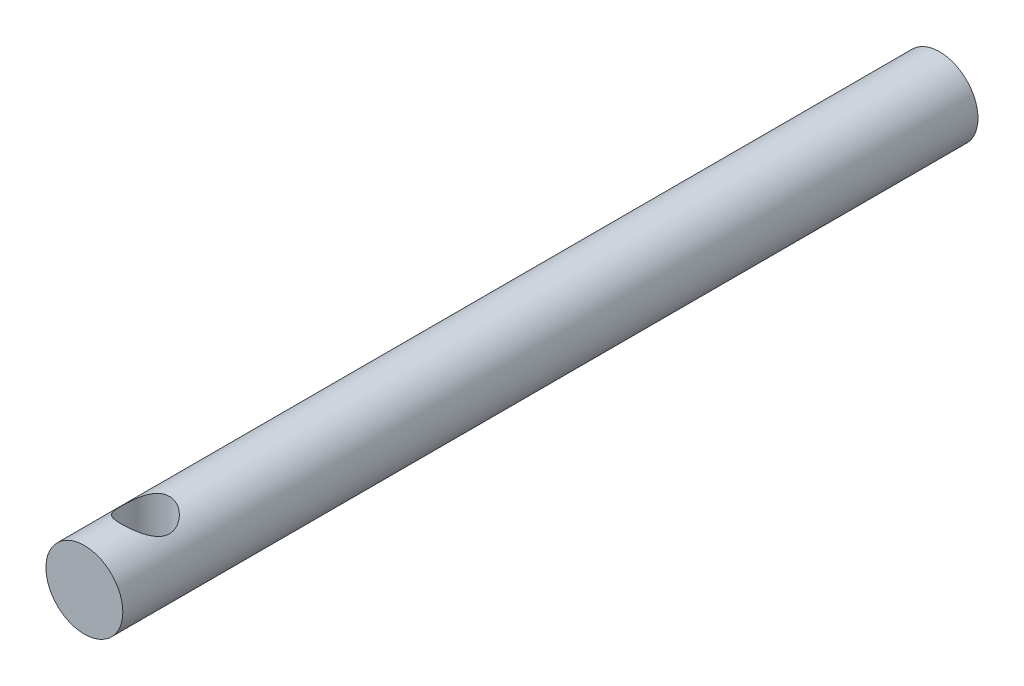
from build123d import *

# Parameters (mm, degrees)
SKETCH1_R                 = 4
BOSS_EXTRUDE1_DEPTH       = 89
SKETCH2_R                 = 2.5
CUT_EXTRUDE1_DEPTH        = 44.5
F_6_0MM_DOWEL_HOLE1_D     = 6
F_6_0MM_DOWEL_HOLE1_DEPTH = 30
F_6_0MM_DOWEL_HOLE1_TIP   = 1.802581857


with BuildPart() as part:
    # Sketch1 → Boss-Extrude1 (new body)
    with BuildSketch(Plane.XY):
        Circle(SKETCH1_R)
    extrude(amount=BOSS_EXTRUDE1_DEPTH)

    # Sketch2 → Cut-Extrude1 (cut, symmetric)
    with BuildSketch(Plane(origin=(0, 0, 0), x_dir=(1, 0, 0), z_dir=(0, 1, 0))):
        with Locations(Location((0, -82.65, 0), (0, 0, 270))):
            Circle(SKETCH2_R)
    extrude(amount=CUT_EXTRUDE1_DEPTH, both=True, mode=Mode.SUBTRACT)

    # 6.0mm Dowel Hole1
    with Locations(Plane(origin=(0, 0, 0), x_dir=(-1, 0, 0), z_dir=(0, 0, -1))):
        with Locations((0, 0)):
            Hole(F_6_0MM_DOWEL_HOLE1_D / 2, depth=F_6_0MM_DOWEL_HOLE1_DEPTH)
            with Locations((0, 0, -(F_6_0MM_DOWEL_HOLE1_DEPTH + F_6_0MM_DOWEL_HOLE1_TIP / 2))):  # 118° drill point
                Cone(0, F_6_0MM_DOWEL_HOLE1_D / 2, F_6_0MM_DOWEL_HOLE1_TIP, mode=Mode.SUBTRACT)


solid = part.part
